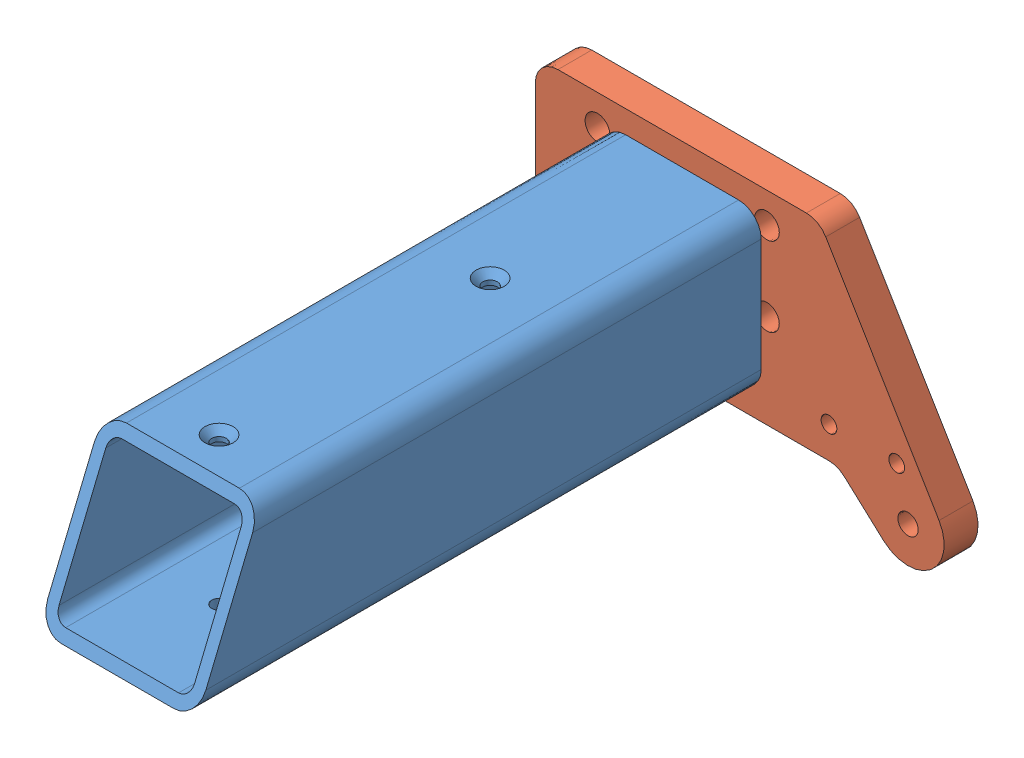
SolidWorks assembly Extrémité berceau.sldasm, configuration Défaut (file format 5000). Lengths in mm.
Overall size (181 112.75 265).
2 component instances, 2 part files, 3 mates.
Components (placement in the parent):
- Tube carré chariot 70 x 70 x 5 x 250-1: Tube carré chariot 70 x 70 x 5 x 250.SLDPRT [Défaut] at origin size (70 70 250)
- Platine 2 berceau 181 x 112.75-1: Platine 2 berceau 181 x 112.75.SLDPRT [Défaut] at (0 0 5) x (0 -1 0) z (0 0 -1) size (112.75 181 20)
Mates (geometry in assembly coordinates):
- Coïncidente135: coincident anti-aligned: plane of Tube carré chariot 70 x 70 x 5 x 250-1 through (-25 -25 0) normal (0 0 -1); plane of Platine 2 berceau 181 x 112.75-1 through (-55 -35 0) normal (0 0 1)
- Coïncidente136: coincident: point of Tube carré chariot 70 x 70 x 5 x 250-1; axis of Platine 2 berceau 181 x 112.75-1 through (0 0 0) axis (0 0 1)
- Parallèle2: parallel aligned: plane of Tube carré chariot 70 x 70 x 5 x 250-1 through (-25 35 250) normal (0 1 0); plane of Platine 2 berceau 181 x 112.75-1 through (-55 45 -15) normal (0 1 0)
